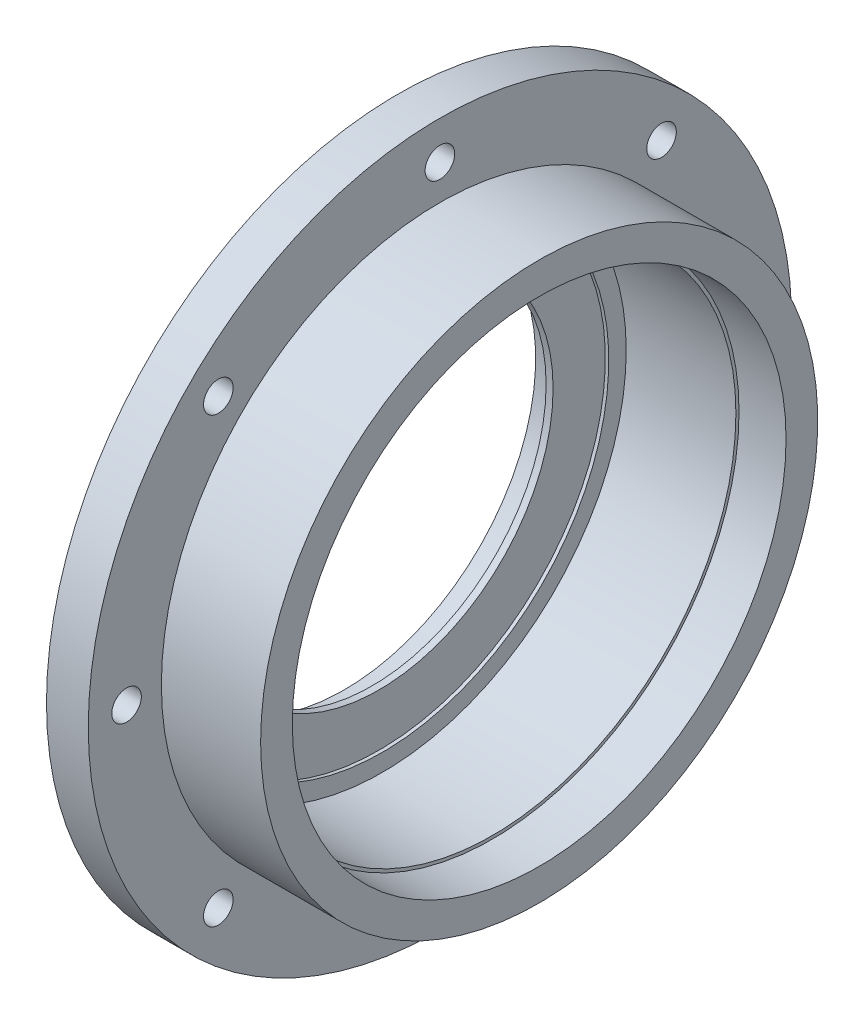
from build123d import *

# Parameters (mm, degrees)
TROU_TARAUD_M101_D           = 8.5
CHANFREIN1_SIZE              = 5
R_P_TITION_CIRCULAIRE1_COUNT = 8


with BuildPart() as part:
    # Esquisse1 → R_volution1 (revolve)
    with BuildSketch(Plane.XY, mode=Mode.PRIVATE) as r_volution1_sk:
        Polygon((11, 70), (42.5, 70), (42.5, 70.9), (56, 70.9), (56, 80), (27.5, 80), (27.5, 101), (15.5, 101), (15.5, 80), (0, 80), (0, 55), (8, 55), (8, 50), (10, 50), (10, 65), (11, 65), align=None)
    revolve(r_volution1_sk.sketch.rotate(Axis((0, 0, 0), (1, 0, 0)), 90), axis=Axis((0, 0, 0), (1, 0, 0)))

    # Trou taraud_ M101 (through all)
    with Locations(Plane(origin=(15.5, 87.535824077, -16.690238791), x_dir=(0, 0, 1), z_dir=(-1, 0, 0))):
        with Locations((16.690238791, 2.464175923)):
            trou_taraud_m101 = Hole(TROU_TARAUD_M101_D / 2)

    # Chanfrein1
    chanfrein1_edges = [part.edges().sort_by_distance(p)[0] for p in [
        (0, 0, -80),
    ]]
    chamfer(chanfrein1_edges, length=CHANFREIN1_SIZE)

    # R_p_tition circulaire1: Trou taraud_ M101 ×8 about axis
    r_p_tition_circulaire1_axis = Axis((0, 0, 0), (1, 0, 0))
    for i in range(1, R_P_TITION_CIRCULAIRE1_COUNT):
        add(trou_taraud_m101.rotate(r_p_tition_circulaire1_axis, i * 360 / R_P_TITION_CIRCULAIRE1_COUNT), mode=Mode.SUBTRACT)


solid = part.part
